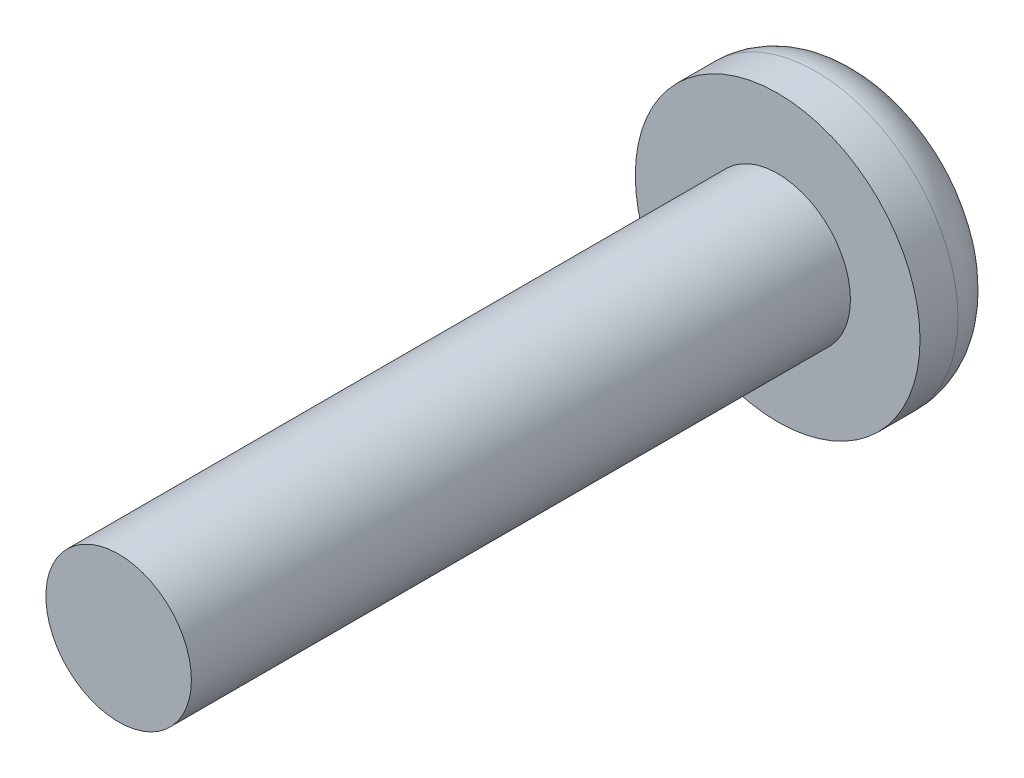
from build123d import *

# Parameters (mm, degrees)
SKETCH1_R          = 1.7526
THREADS_DEPTH      = 15.875
SKETCH2_W          = 3.429
SKETCH2_H          = 2.0828
FILLET_2_R         = 1.1684
SKETCH4_W          = 0.8636
SKETCH4_H          = 1.7526
CUT_EXTRUDE1_DEPTH = 1.0414
CIRPATTERN2_COUNT  = 4


with BuildPart() as part:
    # Sketch1 → THREADS (new body)
    with BuildSketch(Plane.XY):
        Circle(SKETCH1_R)
    extrude(amount=THREADS_DEPTH)

    # Sketch2 → PANHEAD (revolve)
    with BuildSketch(Plane(origin=(0, 0, 0), x_dir=(1, 0, 0), z_dir=(0, 1, 0)), mode=Mode.PRIVATE) as panhead_sk:
        with Locations((1.7145, 1.0414)):
            Rectangle(SKETCH2_W, SKETCH2_H)
    revolve(panhead_sk.sketch.rotate(Axis((0, 0, -4.840317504), (0, 0, 1)), 180), axis=Axis((0, 0, -4.840317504), (0, 0, 1)))

    # FILLET 2
    fillet_2_edges = [part.edges().sort_by_distance(p)[0] for p in [
        (3.429, 0, -2.0828),
    ]]
    fillet(fillet_2_edges, radius=FILLET_2_R)

    # Sketch4 → Cut-Extrude1 (cut)
    with BuildSketch(Plane(origin=(-0.355935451, -0.850723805, -2.0828), x_dir=(-1, 0, 0), z_dir=(0, 0, -1))):
        with Locations((-0.355935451, 1.727023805)):
            Rectangle(SKETCH4_W, SKETCH4_H)
    cut_extrude1 = extrude(amount=-CUT_EXTRUDE1_DEPTH, mode=Mode.SUBTRACT)

    # CirPattern2: Cut-Extrude1 ×4 about axis
    cirpattern2_axis = Axis((0, 0, 65.875), (0, 0, -1))
    for i in range(1, CIRPATTERN2_COUNT):
        add(cut_extrude1.rotate(cirpattern2_axis, i * 360 / CIRPATTERN2_COUNT), mode=Mode.SUBTRACT)


solid = part.part
